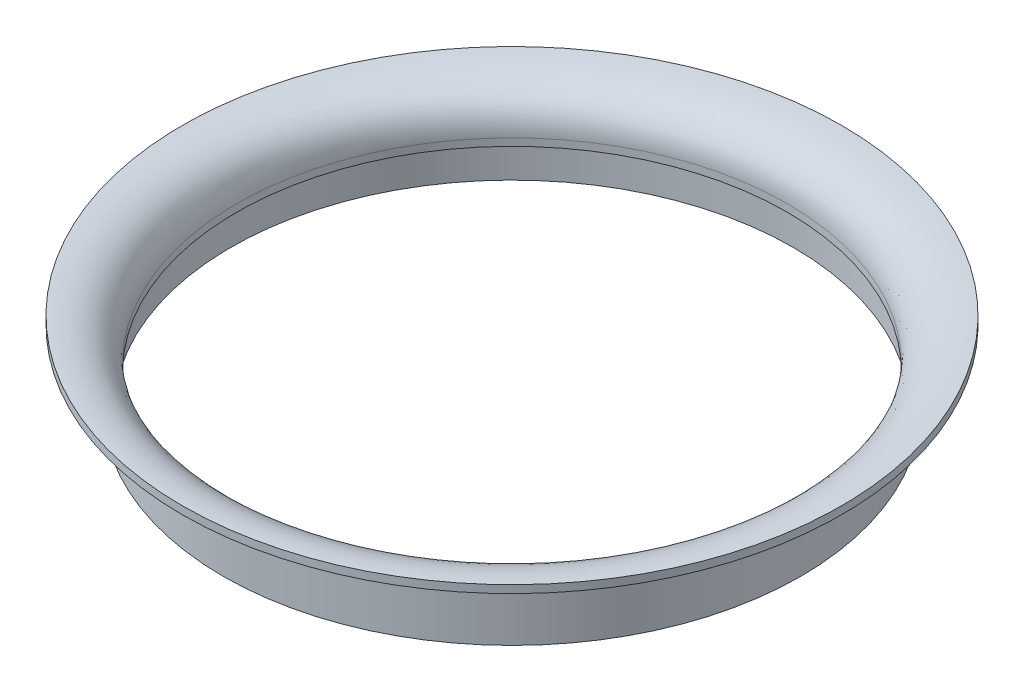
from build123d import *


with BuildPart() as part:
    # Sketch 1 → Revolve 1 (revolve)
    with BuildSketch(Plane.XY, mode=Mode.PRIVATE) as revolve_1_sk:
        with BuildLine():
            add(Edge.make_bspline(
                [(35.5, 5.246277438), (35.5, 8.143447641), (37.308176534, 10.5), (42.5, 10.5)],
                knots=[0, 0, 0, 0, 1, 1, 1, 1], degree=3))
            Line((42.5, 10.5), (42.5, 9.5))
            add(Edge.make_bspline(
                [(37.25, 6), (37.25, 8.103238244), (38.992444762, 9.5), (42.5, 9.5)],
                knots=[0, 0, 0, 0, 1, 1, 1, 1], degree=3))
            Line((37.25, 6), (37.25, 0))
            Line((37.25, 0), (36.25, 0))
            Line((36.25, 0), (36.25, 4.3))
            Line((36.25, 4.3), (35.5, 4.3))
            Line((35.5, 4.3), (35.5, 5.246277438))
        make_face()
    revolve(revolve_1_sk.sketch.rotate(Axis((0, 0, 0), (0, 1, 0)), 90), axis=Axis((0, 0, 0), (0, 1, 0)))


solid = part.part
